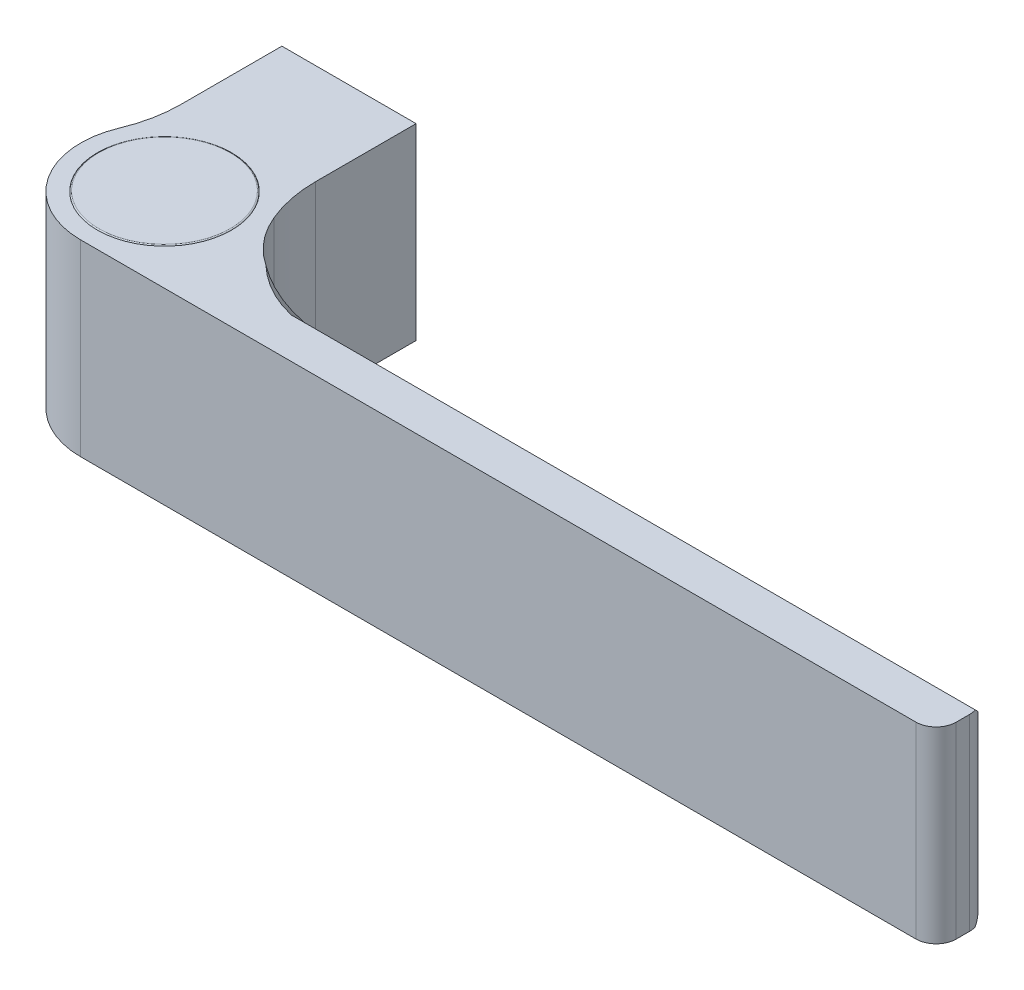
ISO-10303-21;
HEADER;
FILE_DESCRIPTION(('STEP AP214'),'2;1');
FILE_NAME('part.step','',(''),(''),'','','');
FILE_SCHEMA(('AUTOMOTIVE_DESIGN { 1 0 10303 214 1 1 1 1 }'));
ENDSEC;
DATA;
#1=APPLICATION_CONTEXT('core data for automotive mechanical design processes');
#2=APPLICATION_PROTOCOL_DEFINITION('international standard','automotive_design',2000,#1);
#3=PRODUCT_CONTEXT('',#1,'mechanical');
#4=PRODUCT('Part','Part','',(#3));
#5=PRODUCT_RELATED_PRODUCT_CATEGORY('part','',(#4));
#6=PRODUCT_DEFINITION_FORMATION('','',#4);
#7=PRODUCT_DEFINITION_CONTEXT('part definition',#1,'design');
#8=PRODUCT_DEFINITION('design','',#6,#7);
#9=PRODUCT_DEFINITION_SHAPE('','',#8);
#10=(LENGTH_UNIT() NAMED_UNIT(*) SI_UNIT(.MILLI.,.METRE.));
#11=(NAMED_UNIT(*) PLANE_ANGLE_UNIT() SI_UNIT($,.RADIAN.));
#12=(NAMED_UNIT(*) SI_UNIT($,.STERADIAN.) SOLID_ANGLE_UNIT());
#13=UNCERTAINTY_MEASURE_WITH_UNIT(LENGTH_MEASURE(1.E-05),#10,'distance_accuracy_value','');
#14=(GEOMETRIC_REPRESENTATION_CONTEXT(3) GLOBAL_UNCERTAINTY_ASSIGNED_CONTEXT((#13)) GLOBAL_UNIT_ASSIGNED_CONTEXT((#10,
#11,#12)) REPRESENTATION_CONTEXT('',''));
#15=CARTESIAN_POINT('',(0.,0.,0.));
#16=DIRECTION('',(0.,0.,1.));
#17=DIRECTION('',(1.,0.,0.));
#18=AXIS2_PLACEMENT_3D('',#15,#16,#17);
#19=CARTESIAN_POINT('',(0.,21.1,27.5));
#20=DIRECTION('',(0.,-1.,0.));
#21=DIRECTION('',(0.,0.,1.));
#22=AXIS2_PLACEMENT_3D('',#19,#20,#21);
#23=PLANE('',#22);
#24=CARTESIAN_POINT('',(0.,21.1,27.5));
#25=DIRECTION('',(0.,1.,0.));
#26=DIRECTION('',(-1.,0.,0.));
#27=AXIS2_PLACEMENT_3D('',#24,#25,#26);
#28=CIRCLE('',#27,9.8);
#29=CARTESIAN_POINT('',(-9.8,21.1,27.5));
#30=VERTEX_POINT('',#29);
#31=EDGE_CURVE('E9',#30,#30,#28,.T.);
#32=ORIENTED_EDGE('',*,*,#31,.T.);
#33=EDGE_LOOP('',(#32));
#34=FACE_BOUND('',#33,.T.);
#35=ADVANCED_FACE('F15',(#34),#23,.F.);
#36=CARTESIAN_POINT('',(0.,20.9,27.5));
#37=DIRECTION('',(0.,-1.,0.));
#38=DIRECTION('',(1.,0.,0.));
#39=AXIS2_PLACEMENT_3D('',#36,#37,#38);
#40=TOROIDAL_SURFACE('',#39,9.8,0.2);
#41=ORIENTED_EDGE('',*,*,#31,.F.);
#42=EDGE_LOOP('',(#41));
#43=FACE_BOUND('',#42,.T.);
#44=CARTESIAN_POINT('',(0.,20.9,27.5));
#45=DIRECTION('',(0.,1.,0.));
#46=DIRECTION('',(-1.,0.,0.));
#47=AXIS2_PLACEMENT_3D('',#44,#45,#46);
#48=CIRCLE('',#47,10.);
#49=CARTESIAN_POINT('',(-10.,20.9,27.5));
#50=VERTEX_POINT('',#49);
#51=EDGE_CURVE('E27',#50,#50,#48,.T.);
#52=ORIENTED_EDGE('',*,*,#51,.T.);
#53=EDGE_LOOP('',(#52));
#54=FACE_BOUND('',#53,.T.);
#55=ADVANCED_FACE('F430',(#43,#54),#40,.T.);
#56=CARTESIAN_POINT('',(0.,-7.1,27.5));
#57=DIRECTION('',(0.,1.,0.));
#58=DIRECTION('',(0.,0.,1.));
#59=AXIS2_PLACEMENT_3D('',#56,#57,#58);
#60=PLANE('',#59);
#61=CARTESIAN_POINT('',(0.,-7.1,27.5));
#62=DIRECTION('',(0.,-1.,0.));
#63=DIRECTION('',(-1.,0.,0.));
#64=AXIS2_PLACEMENT_3D('',#61,#62,#63);
#65=CIRCLE('',#64,9.8);
#66=CARTESIAN_POINT('',(-9.8,-7.1,27.5));
#67=VERTEX_POINT('',#66);
#68=EDGE_CURVE('E540',#67,#67,#65,.T.);
#69=ORIENTED_EDGE('',*,*,#68,.T.);
#70=EDGE_LOOP('',(#69));
#71=FACE_BOUND('',#70,.T.);
#72=ADVANCED_FACE('F436',(#71),#60,.F.);
#73=CARTESIAN_POINT('',(0.,14.,14.5));
#74=DIRECTION('',(0.,0.,-1.));
#75=DIRECTION('',(0.,1.,0.));
#76=AXIS2_PLACEMENT_3D('',#73,#74,#75);
#77=PLANE('',#76);
#78=CARTESIAN_POINT('',(0.,14.,14.5));
#79=DIRECTION('',(0.,0.,-1.));
#80=DIRECTION('',(0.,1.,0.));
#81=AXIS2_PLACEMENT_3D('',#78,#79,#80);
#82=CIRCLE('',#81,3.);
#83=CARTESIAN_POINT('',(0.,17.,14.5));
#84=VERTEX_POINT('',#83);
#85=EDGE_CURVE('E533',#84,#84,#82,.T.);
#86=ORIENTED_EDGE('',*,*,#85,.T.);
#87=EDGE_LOOP('',(#86));
#88=FACE_BOUND('',#87,.T.);
#89=ADVANCED_FACE('F450',(#88),#77,.T.);
#90=CARTESIAN_POINT('',(0.,0.,14.5));
#91=DIRECTION('',(0.,0.,-1.));
#92=DIRECTION('',(0.,1.,0.));
#93=AXIS2_PLACEMENT_3D('',#90,#91,#92);
#94=PLANE('',#93);
#95=CARTESIAN_POINT('',(0.,0.,14.5));
#96=DIRECTION('',(0.,0.,-1.));
#97=DIRECTION('',(0.,1.,0.));
#98=AXIS2_PLACEMENT_3D('',#95,#96,#97);
#99=CIRCLE('',#98,3.);
#100=CARTESIAN_POINT('',(0.,3.,14.5));
#101=VERTEX_POINT('',#100);
#102=EDGE_CURVE('E151',#101,#101,#99,.T.);
#103=ORIENTED_EDGE('',*,*,#102,.T.);
#104=EDGE_LOOP('',(#103));
#105=FACE_BOUND('',#104,.T.);
#106=ADVANCED_FACE('F456',(#105),#94,.T.);
#107=CARTESIAN_POINT('',(0.,-6.9,27.5));
#108=DIRECTION('',(0.,1.,0.));
#109=DIRECTION('',(-1.,0.,0.));
#110=AXIS2_PLACEMENT_3D('',#107,#108,#109);
#111=TOROIDAL_SURFACE('',#110,9.8,0.2);
#112=ORIENTED_EDGE('',*,*,#68,.F.);
#113=EDGE_LOOP('',(#112));
#114=FACE_BOUND('',#113,.T.);
#115=CARTESIAN_POINT('',(0.,-6.9,27.5));
#116=DIRECTION('',(0.,-1.,0.));
#117=DIRECTION('',(-1.,0.,0.));
#118=AXIS2_PLACEMENT_3D('',#115,#116,#117);
#119=CIRCLE('',#118,10.);
#120=CARTESIAN_POINT('',(-10.,-6.9,27.5));
#121=VERTEX_POINT('',#120);
#122=EDGE_CURVE('E536',#121,#121,#119,.T.);
#123=ORIENTED_EDGE('',*,*,#122,.T.);
#124=EDGE_LOOP('',(#123));
#125=FACE_BOUND('',#124,.T.);
#126=ADVANCED_FACE('F452',(#114,#125),#111,.T.);
#127=CARTESIAN_POINT('',(0.,14.,14.5));
#128=DIRECTION('',(0.,0.,-1.));
#129=DIRECTION('',(0.,1.,0.));
#130=AXIS2_PLACEMENT_3D('',#127,#128,#129);
#131=CYLINDRICAL_SURFACE('',#130,3.);
#132=ORIENTED_EDGE('',*,*,#85,.F.);
#133=EDGE_LOOP('',(#132));
#134=FACE_BOUND('',#133,.T.);
#135=CARTESIAN_POINT('',(0.,14.,0.25));
#136=DIRECTION('',(0.,0.,-1.));
#137=DIRECTION('',(0.,1.,0.));
#138=AXIS2_PLACEMENT_3D('',#135,#136,#137);
#139=CIRCLE('',#138,3.);
#140=CARTESIAN_POINT('',(0.,17.,0.25));
#141=VERTEX_POINT('',#140);
#142=EDGE_CURVE('E20',#141,#141,#139,.F.);
#143=ORIENTED_EDGE('',*,*,#142,.F.);
#144=EDGE_LOOP('',(#143));
#145=FACE_BOUND('',#144,.T.);
#146=ADVANCED_FACE('F455',(#134,#145),#131,.F.);
#147=CARTESIAN_POINT('',(0.,0.,14.5));
#148=DIRECTION('',(0.,0.,-1.));
#149=DIRECTION('',(0.,1.,0.));
#150=AXIS2_PLACEMENT_3D('',#147,#148,#149);
#151=CYLINDRICAL_SURFACE('',#150,3.);
#152=ORIENTED_EDGE('',*,*,#102,.F.);
#153=EDGE_LOOP('',(#152));
#154=FACE_BOUND('',#153,.T.);
#155=CARTESIAN_POINT('',(0.,0.,0.25));
#156=DIRECTION('',(0.,0.,-1.));
#157=DIRECTION('',(0.,1.,0.));
#158=AXIS2_PLACEMENT_3D('',#155,#156,#157);
#159=CIRCLE('',#158,3.);
#160=CARTESIAN_POINT('',(0.,3.,0.25));
#161=VERTEX_POINT('',#160);
#162=EDGE_CURVE('E192',#161,#161,#159,.F.);
#163=ORIENTED_EDGE('',*,*,#162,.F.);
#164=EDGE_LOOP('',(#163));
#165=FACE_BOUND('',#164,.T.);
#166=ADVANCED_FACE('F463',(#154,#165),#151,.F.);
#167=CARTESIAN_POINT('',(0.,-4.,27.5));
#168=DIRECTION('',(0.,1.,0.));
#169=DIRECTION('',(1.,0.,0.));
#170=AXIS2_PLACEMENT_3D('',#167,#168,#169);
#171=CYLINDRICAL_SURFACE('',#170,10.);
#172=ORIENTED_EDGE('',*,*,#122,.F.);
#173=EDGE_LOOP('',(#172));
#174=FACE_BOUND('',#173,.T.);
#175=CARTESIAN_POINT('',(0.,-7.,27.5));
#176=DIRECTION('',(0.,1.,0.));
#177=DIRECTION('',(-1.,0.,0.));
#178=AXIS2_PLACEMENT_3D('',#175,#176,#177);
#179=CIRCLE('',#178,10.);
#180=CARTESIAN_POINT('',(-10.,-7.,27.5));
#181=VERTEX_POINT('',#180);
#182=EDGE_CURVE('E237',#181,#181,#179,.T.);
#183=ORIENTED_EDGE('',*,*,#182,.F.);
#184=EDGE_LOOP('',(#183));
#185=FACE_BOUND('',#184,.T.);
#186=ADVANCED_FACE('F470',(#174,#185),#171,.F.);
#187=CARTESIAN_POINT('',(0.,14.,0.750000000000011));
#188=DIRECTION('',(0.,0.,-1.));
#189=DIRECTION('',(0.,1.,0.));
#190=AXIS2_PLACEMENT_3D('',#187,#188,#189);
#191=CONICAL_SURFACE('',#190,2.5,0.785398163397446);
#192=CARTESIAN_POINT('',(0.,14.,0.));
#193=DIRECTION('',(0.,0.,1.));
#194=DIRECTION('',(0.,-1.,0.));
#195=AXIS2_PLACEMENT_3D('',#192,#193,#194);
#196=CIRCLE('',#195,3.25);
#197=CARTESIAN_POINT('',(0.,10.75,0.));
#198=VERTEX_POINT('',#197);
#199=EDGE_CURVE('E356',#198,#198,#196,.T.);
#200=ORIENTED_EDGE('',*,*,#199,.F.);
#201=EDGE_LOOP('',(#200));
#202=FACE_BOUND('',#201,.T.);
#203=ORIENTED_EDGE('',*,*,#142,.T.);
#204=EDGE_LOOP('',(#203));
#205=FACE_BOUND('',#204,.T.);
#206=ADVANCED_FACE('F502',(#202,#205),#191,.F.);
#207=CARTESIAN_POINT('',(0.,0.,0.750000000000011));
#208=DIRECTION('',(0.,0.,-1.));
#209=DIRECTION('',(0.,1.,0.));
#210=AXIS2_PLACEMENT_3D('',#207,#208,#209);
#211=CONICAL_SURFACE('',#210,2.5,0.785398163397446);
#212=ORIENTED_EDGE('',*,*,#162,.T.);
#213=EDGE_LOOP('',(#212));
#214=FACE_BOUND('',#213,.T.);
#215=CARTESIAN_POINT('',(0.,0.,0.));
#216=DIRECTION('',(0.,0.,1.));
#217=DIRECTION('',(0.,-1.,0.));
#218=AXIS2_PLACEMENT_3D('',#215,#216,#217);
#219=CIRCLE('',#218,3.25);
#220=CARTESIAN_POINT('',(0.,-3.25,0.));
#221=VERTEX_POINT('',#220);
#222=EDGE_CURVE('E373',#221,#221,#219,.T.);
#223=ORIENTED_EDGE('',*,*,#222,.F.);
#224=EDGE_LOOP('',(#223));
#225=FACE_BOUND('',#224,.T.);
#226=ADVANCED_FACE('F197',(#214,#225),#211,.F.);
#227=CARTESIAN_POINT('',(25.4165300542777,-7.,34.));
#228=CARTESIAN_POINT('',(22.3822222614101,-7.3332196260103,33.6667803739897));
#229=CARTESIAN_POINT('',(19.4967402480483,-8.1238734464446,32.8761265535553));
#230=CARTESIAN_POINT('',(17.0799276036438,-9.2649968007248,31.7350031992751));
#231=B_SPLINE_CURVE_WITH_KNOTS('',3,(#227,#228,#229,#230),.UNSPECIFIED.,.F.,.F.,(4,4),(0.,1.),.UNSPECIFIED.);
#232=DIRECTION('',(0.,0.707106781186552,-0.707106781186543));
#233=VECTOR('',#232,1.);
#234=SURFACE_OF_LINEAR_EXTRUSION('',#231,#233);
#235=CARTESIAN_POINT('',(17.0799276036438,-7.00000000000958,29.4700063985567));
#236=CARTESIAN_POINT('',(17.4619964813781,-7.00000000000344,29.8308120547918));
#237=CARTESIAN_POINT('',(17.8584297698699,-7.00000000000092,30.1765777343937));
#238=CARTESIAN_POINT('',(18.6785782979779,-6.99999999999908,30.8350602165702));
#239=CARTESIAN_POINT('',(19.1023242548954,-6.99999999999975,31.1477387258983));
#240=CARTESIAN_POINT('',(19.9763809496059,-7.00000000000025,31.7373246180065));
#241=CARTESIAN_POINT('',(20.426784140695,-7.00000000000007,32.0140954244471));
#242=CARTESIAN_POINT('',(21.3499718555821,-6.99999999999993,32.5266736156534));
#243=CARTESIAN_POINT('',(21.8227418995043,-6.99999999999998,32.7625070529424));
#244=CARTESIAN_POINT('',(22.8050849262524,-7.00000000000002,33.1971640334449));
#245=CARTESIAN_POINT('',(23.3153669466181,-7.,33.3944022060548));
#246=CARTESIAN_POINT('',(24.0939087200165,-7.,33.6513851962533));
#247=CARTESIAN_POINT('',(24.3558587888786,-7.,33.7306226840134));
#248=CARTESIAN_POINT('',(24.8835150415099,-7.,33.8755764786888));
#249=CARTESIAN_POINT('',(25.1492218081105,-7.,33.9412906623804));
#250=CARTESIAN_POINT('',(25.4165300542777,-7.,34.));
#251=B_SPLINE_CURVE_WITH_KNOTS('',3,(#235,#236,#237,#238,#239,#240,#241,#242,#243,#244,#245,
#246,#247,#248,#249,#250),.UNSPECIFIED.,.F.,.F.,(4,2,2,2,2,2,2,4),(0.,1.57628478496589,
3.15437436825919,4.73830050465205,6.3212149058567,7.95956468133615,8.78026720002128,
9.60109847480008),.UNSPECIFIED.);
#252=CARTESIAN_POINT('',(17.0799276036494,-7.00000000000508,29.4700063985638));
#253=VERTEX_POINT('',#252);
#254=CARTESIAN_POINT('',(25.4165300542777,-7.,34.));
#255=VERTEX_POINT('',#254);
#256=EDGE_CURVE('E243',#253,#255,#251,.T.);
#257=ORIENTED_EDGE('',*,*,#256,.F.);
#258=CARTESIAN_POINT('',(17.0799276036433,-7.00000000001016,29.4700063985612));
#259=CARTESIAN_POINT('',(17.182501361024,-6.97171133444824,29.5385806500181));
#260=CARTESIAN_POINT('',(17.2859206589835,-6.94341803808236,29.6058881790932));
#261=CARTESIAN_POINT('',(17.4942076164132,-6.88687534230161,29.7378167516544));
#262=CARTESIAN_POINT('',(17.5990724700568,-6.85862595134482,29.8024422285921));
#263=CARTESIAN_POINT('',(17.8102406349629,-6.80215908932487,29.9290176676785));
#264=CARTESIAN_POINT('',(17.9165421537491,-6.77394161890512,29.9909706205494));
#265=CARTESIAN_POINT('',(18.1305763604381,-6.7175270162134,30.1122079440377));
#266=CARTESIAN_POINT('',(18.2383081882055,-6.68932988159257,30.1714938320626));
#267=CARTESIAN_POINT('',(18.4551989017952,-6.63294450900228,30.2873995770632));
#268=CARTESIAN_POINT('',(18.5643577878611,-6.60475627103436,30.3440194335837));
#269=CARTESIAN_POINT('',(18.7841010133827,-6.54837747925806,30.4545911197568));
#270=CARTESIAN_POINT('',(18.8946861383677,-6.52018693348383,30.5085413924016));
#271=CARTESIAN_POINT('',(19.1172824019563,-6.46379254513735,30.6137669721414));
#272=CARTESIAN_POINT('',(19.2292950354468,-6.43558872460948,30.6650391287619));
#273=CARTESIAN_POINT('',(19.4547490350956,-6.37915691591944,30.7648972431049));
#274=CARTESIAN_POINT('',(19.5681925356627,-6.35092897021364,30.8134784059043));
#275=CARTESIAN_POINT('',(19.6822216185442,-6.32271603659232,30.8606531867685));
#276=B_SPLINE_CURVE_WITH_KNOTS('',3,(#258,#259,#260,#261,#262,#263,#264,#265,#266,#267,#268,
#269,#270,#271,#272,#273,#274,#275),.UNSPECIFIED.,.F.,.F.,(4,2,2,2,2,2,2,2,4),(0.,
0.379749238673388,0.758843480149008,1.13750186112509,1.51594200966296,1.89438222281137,
2.27304061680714,2.65213486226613,3.03188419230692),.UNSPECIFIED.);
#277=CARTESIAN_POINT('',(19.6822215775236,-6.32271612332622,30.8606533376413));
#278=VERTEX_POINT('',#277);
#279=EDGE_CURVE('E145',#253,#278,#276,.T.);
#280=ORIENTED_EDGE('',*,*,#279,.T.);
#281=CARTESIAN_POINT('',(25.4165300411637,-5.00000000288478,32.0000000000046));
#282=CARTESIAN_POINT('',(25.0360234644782,-5.08368728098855,32.0001625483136));
#283=CARTESIAN_POINT('',(24.6555809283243,-5.16778751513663,31.9857573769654));
#284=CARTESIAN_POINT('',(23.899733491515,-5.33614701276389,31.9282779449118));
#285=CARTESIAN_POINT('',(23.5243119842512,-5.42040097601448,31.8854064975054));
#286=CARTESIAN_POINT('',(22.8552807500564,-5.57206188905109,31.7832556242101));
#287=CARTESIAN_POINT('',(22.5608317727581,-5.63934368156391,31.7292139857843));
#288=CARTESIAN_POINT('',(21.9757235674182,-5.77429015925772,31.6035996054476));
#289=CARTESIAN_POINT('',(21.6850649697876,-5.84195490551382,31.5320239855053));
#290=CARTESIAN_POINT('',(21.1053781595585,-5.97834760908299,31.3707045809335));
#291=CARTESIAN_POINT('',(20.8164051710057,-6.04707895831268,31.2807652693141));
#292=CARTESIAN_POINT('',(20.2445202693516,-6.18475552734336,31.0835926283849));
#293=CARTESIAN_POINT('',(19.9616075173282,-6.25370071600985,30.9763617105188));
#294=CARTESIAN_POINT('',(19.6822215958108,-6.32271621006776,30.8606533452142));
#295=B_SPLINE_CURVE_WITH_KNOTS('',3,(#281,#282,#283,#284,#285,#286,#287,#288,#289,#290,#291,
#292,#293,#294),.UNSPECIFIED.,.F.,.F.,(4,2,2,2,2,2,4),(0.,1.16857682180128,2.32891597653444,
3.24891760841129,4.16907035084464,5.0995855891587,6.02997117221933),.UNSPECIFIED.);
#296=CARTESIAN_POINT('',(25.4165300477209,-5.0000000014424,32.0000000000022));
#297=VERTEX_POINT('',#296);
#298=EDGE_CURVE('E139',#297,#278,#295,.T.);
#299=ORIENTED_EDGE('',*,*,#298,.F.);
#300=DIRECTION('',(0.,0.707106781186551,-0.707106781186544));
#301=VECTOR('',#300,1.);
#302=CARTESIAN_POINT('',(25.416530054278,-7.,34.));
#303=LINE('',#302,#301);
#304=EDGE_CURVE('E143',#297,#255,#303,.F.);
#305=ORIENTED_EDGE('',*,*,#304,.T.);
#306=EDGE_LOOP('',(#257,#280,#299,#305));
#307=FACE_BOUND('',#306,.T.);
#308=ADVANCED_FACE('F142',(#307),#234,.T.);
#309=CARTESIAN_POINT('',(25.4114323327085,-5.6617904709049,17.0256546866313));
#310=DIRECTION('',(0.,-1.,0.));
#311=DIRECTION('',(0.0003404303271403,0.,0.999999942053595));
#312=AXIS2_PLACEMENT_3D('',#309,#310,#311);
#313=CYLINDRICAL_SURFACE('',#312,14.9743461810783);
#314=ORIENTED_EDGE('',*,*,#298,.T.);
#315=DIRECTION('',(0.,-1.,0.));
#316=VECTOR('',#315,1.);
#317=CARTESIAN_POINT('',(19.6822215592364,-5.6617904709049,30.8606533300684));
#318=LINE('',#317,#316);
#319=CARTESIAN_POINT('',(19.6822215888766,-6.999999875,30.8606532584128));
#320=VERTEX_POINT('',#319);
#321=EDGE_CURVE('E291',#278,#320,#318,.T.);
#322=ORIENTED_EDGE('',*,*,#321,.T.);
#323=CARTESIAN_POINT('',(25.4114323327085,-7.,17.0256546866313));
#324=DIRECTION('',(0.,1.,0.));
#325=DIRECTION('',(-0.382601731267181,0.,0.923913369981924));
#326=AXIS2_PLACEMENT_3D('',#323,#324,#325);
#327=CIRCLE('',#326,14.9743461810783);
#328=CARTESIAN_POINT('',(25.4165300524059,-7.,32.0000000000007));
#329=VERTEX_POINT('',#328);
#330=EDGE_CURVE('E180',#320,#329,#327,.T.);
#331=ORIENTED_EDGE('',*,*,#330,.T.);
#332=DIRECTION('',(0.,-1.,0.));
#333=VECTOR('',#332,1.);
#334=CARTESIAN_POINT('',(25.4165300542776,-5.6617904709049,32.));
#335=LINE('',#334,#333);
#336=EDGE_CURVE('E168',#329,#297,#335,.F.);
#337=ORIENTED_EDGE('',*,*,#336,.T.);
#338=EDGE_LOOP('',(#314,#322,#331,#337));
#339=FACE_BOUND('',#338,.T.);
#340=ADVANCED_FACE('F17',(#339),#313,.T.);
#341=CARTESIAN_POINT('',(127.5,-7.,32.));
#342=DIRECTION('',(0.,0.,1.));
#343=DIRECTION('',(1.,0.,0.));
#344=AXIS2_PLACEMENT_3D('',#341,#342,#343);
#345=PLANE('',#344);
#346=DIRECTION('',(0.,-1.,0.));
#347=VECTOR('',#346,1.);
#348=CARTESIAN_POINT('',(124.5,-7.,32.));
#349=LINE('',#348,#347);
#350=CARTESIAN_POINT('',(124.5,-5.,32.));
#351=VERTEX_POINT('',#350);
#352=CARTESIAN_POINT('',(124.5,19.,32.));
#353=VERTEX_POINT('',#352);
#354=EDGE_CURVE('E177',#351,#353,#349,.F.);
#355=ORIENTED_EDGE('',*,*,#354,.F.);
#356=DIRECTION('',(-1.,0.,0.));
#357=VECTOR('',#356,1.);
#358=CARTESIAN_POINT('',(124.5,-5.,32.));
#359=LINE('',#358,#357);
#360=EDGE_CURVE('E159',#351,#297,#359,.T.);
#361=ORIENTED_EDGE('',*,*,#360,.T.);
#362=DIRECTION('',(0.,-1.,0.));
#363=VECTOR('',#362,1.);
#364=CARTESIAN_POINT('',(25.4165300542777,-7.,32.));
#365=LINE('',#364,#363);
#366=CARTESIAN_POINT('',(25.4165300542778,19.,32.));
#367=VERTEX_POINT('',#366);
#368=EDGE_CURVE('E166',#367,#297,#365,.T.);
#369=ORIENTED_EDGE('',*,*,#368,.F.);
#370=DIRECTION('',(1.,0.,0.));
#371=VECTOR('',#370,1.);
#372=CARTESIAN_POINT('',(25.4165300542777,19.,32.));
#373=LINE('',#372,#371);
#374=EDGE_CURVE('E178',#367,#353,#373,.T.);
#375=ORIENTED_EDGE('',*,*,#374,.T.);
#376=EDGE_LOOP('',(#355,#361,#369,#375));
#377=FACE_BOUND('',#376,.T.);
#378=ADVANCED_FACE('F176',(#377),#345,.F.);
#379=CARTESIAN_POINT('',(127.5,-7.,34.));
#380=DIRECTION('',(0.,-0.707106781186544,-0.707106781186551));
#381=DIRECTION('',(-1.,0.,0.));
#382=AXIS2_PLACEMENT_3D('',#379,#380,#381);
#383=PLANE('',#382);
#384=ORIENTED_EDGE('',*,*,#304,.F.);
#385=ORIENTED_EDGE('',*,*,#360,.F.);
#386=CARTESIAN_POINT('',(124.5,-8.,35.));
#387=DIRECTION('',(0.,-0.707106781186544,-0.707106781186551));
#388=DIRECTION('',(0.,-0.707106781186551,0.707106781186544));
#389=AXIS2_PLACEMENT_3D('',#386,#387,#388);
#390=ELLIPSE('',#389,4.24264068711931,3.);
#391=CARTESIAN_POINT('',(127.328427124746,-7.,34.));
#392=VERTEX_POINT('',#391);
#393=EDGE_CURVE('E289',#351,#392,#390,.T.);
#394=ORIENTED_EDGE('',*,*,#393,.T.);
#395=CARTESIAN_POINT('',(25.4165300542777,-7.,34.));
#396=CARTESIAN_POINT('',(127.328427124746,-7.,34.));
#397=B_SPLINE_CURVE_WITH_KNOTS('',1,(#395,#396),.UNSPECIFIED.,.F.,.F.,(2,2),(0.,1.),.UNSPECIFIED.);
#398=EDGE_CURVE('E161',#255,#392,#397,.T.);
#399=ORIENTED_EDGE('',*,*,#398,.F.);
#400=EDGE_LOOP('',(#384,#385,#394,#399));
#401=FACE_BOUND('',#400,.T.);
#402=ADVANCED_FACE('F156',(#401),#383,.T.);
#403=CARTESIAN_POINT('',(0.,-7.,27.5));
#404=DIRECTION('',(0.,-1.,0.));
#405=DIRECTION('',(1.,0.,0.));
#406=AXIS2_PLACEMENT_3D('',#403,#404,#405);
#407=PLANE('',#406);
#408=CARTESIAN_POINT('',(0.,-7.,27.5));
#409=DIRECTION('',(0.,-1.,0.));
#410=DIRECTION('',(0.923076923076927,0.,-0.384615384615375));
#411=AXIS2_PLACEMENT_3D('',#408,#409,#410);
#412=CIRCLE('',#411,12.5);
#413=CARTESIAN_POINT('',(11.5384615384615,-7.,22.6923076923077));
#414=VERTEX_POINT('',#413);
#415=CARTESIAN_POINT('',(11.5529682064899,-7.,22.7272727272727));
#416=VERTEX_POINT('',#415);
#417=EDGE_CURVE('E232',#414,#416,#412,.T.);
#418=ORIENTED_EDGE('',*,*,#417,.T.);
#419=CARTESIAN_POINT('',(25.4165300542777,-7.,17.));
#420=DIRECTION('',(0.,-1.,0.));
#421=DIRECTION('',(1.,0.,0.));
#422=AXIS2_PLACEMENT_3D('',#419,#420,#421);
#423=CIRCLE('',#422,15.);
#424=EDGE_CURVE('E250',#416,#253,#423,.F.);
#425=ORIENTED_EDGE('',*,*,#424,.T.);
#426=ORIENTED_EDGE('',*,*,#256,.T.);
#427=ORIENTED_EDGE('',*,*,#398,.T.);
#428=CARTESIAN_POINT('',(124.5,-7.,35.));
#429=DIRECTION('',(0.,-1.,0.));
#430=DIRECTION('',(1.,0.,0.));
#431=AXIS2_PLACEMENT_3D('',#428,#429,#430);
#432=CIRCLE('',#431,3.);
#433=CARTESIAN_POINT('',(127.5,-7.,35.));
#434=VERTEX_POINT('',#433);
#435=EDGE_CURVE('E241',#392,#434,#432,.T.);
#436=ORIENTED_EDGE('',*,*,#435,.T.);
#437=DIRECTION('',(0.,0.,1.));
#438=VECTOR('',#437,1.);
#439=CARTESIAN_POINT('',(127.5,-7.,35.));
#440=LINE('',#439,#438);
#441=CARTESIAN_POINT('',(127.5,-7.,37.));
#442=VERTEX_POINT('',#441);
#443=EDGE_CURVE('E408',#434,#442,#440,.T.);
#444=ORIENTED_EDGE('',*,*,#443,.T.);
#445=CARTESIAN_POINT('',(124.5,-7.,37.));
#446=DIRECTION('',(0.,-1.,0.));
#447=DIRECTION('',(1.,0.,0.));
#448=AXIS2_PLACEMENT_3D('',#445,#446,#447);
#449=CIRCLE('',#448,3.);
#450=CARTESIAN_POINT('',(124.5,-7.,40.));
#451=VERTEX_POINT('',#450);
#452=EDGE_CURVE('E395',#442,#451,#449,.T.);
#453=ORIENTED_EDGE('',*,*,#452,.T.);
#454=DIRECTION('',(-1.,0.,0.));
#455=VECTOR('',#454,1.);
#456=CARTESIAN_POINT('',(124.5,-7.,40.));
#457=LINE('',#456,#455);
#458=CARTESIAN_POINT('',(0.,-7.,40.));
#459=VERTEX_POINT('',#458);
#460=EDGE_CURVE('E390',#451,#459,#457,.T.);
#461=ORIENTED_EDGE('',*,*,#460,.T.);
#462=CARTESIAN_POINT('',(0.,-7.,27.5));
#463=DIRECTION('',(0.,-1.,0.));
#464=DIRECTION('',(-1.,0.,0.));
#465=AXIS2_PLACEMENT_3D('',#462,#463,#464);
#466=CIRCLE('',#465,12.5);
#467=CARTESIAN_POINT('',(-11.5384615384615,-7.,22.6923076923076));
#468=VERTEX_POINT('',#467);
#469=EDGE_CURVE('E382',#459,#468,#466,.T.);
#470=ORIENTED_EDGE('',*,*,#469,.T.);
#471=CARTESIAN_POINT('',(-30.,-7.,15.));
#472=DIRECTION('',(0.,1.,0.));
#473=DIRECTION('',(0.923076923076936,0.,0.384615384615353));
#474=AXIS2_PLACEMENT_3D('',#471,#472,#473);
#475=CIRCLE('',#474,20.);
#476=CARTESIAN_POINT('',(-10.,-7.,15.));
#477=VERTEX_POINT('',#476);
#478=EDGE_CURVE('E367',#468,#477,#475,.T.);
#479=ORIENTED_EDGE('',*,*,#478,.T.);
#480=DIRECTION('',(0.,0.,-1.));
#481=VECTOR('',#480,1.);
#482=CARTESIAN_POINT('',(-10.,-7.,14.9999999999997));
#483=LINE('',#482,#481);
#484=CARTESIAN_POINT('',(-10.,-7.,0.));
#485=VERTEX_POINT('',#484);
#486=EDGE_CURVE('E370',#477,#485,#483,.T.);
#487=ORIENTED_EDGE('',*,*,#486,.T.);
#488=DIRECTION('',(1.,0.,0.));
#489=VECTOR('',#488,1.);
#490=CARTESIAN_POINT('',(-10.,-7.,0.));
#491=LINE('',#490,#489);
#492=CARTESIAN_POINT('',(10.,-7.,0.));
#493=VERTEX_POINT('',#492);
#494=EDGE_CURVE('E355',#485,#493,#491,.T.);
#495=ORIENTED_EDGE('',*,*,#494,.T.);
#496=DIRECTION('',(0.,0.,1.));
#497=VECTOR('',#496,1.);
#498=CARTESIAN_POINT('',(10.,-7.,0.));
#499=LINE('',#498,#497);
#500=CARTESIAN_POINT('',(10.,-7.,15.));
#501=VERTEX_POINT('',#500);
#502=EDGE_CURVE('E351',#493,#501,#499,.T.);
#503=ORIENTED_EDGE('',*,*,#502,.T.);
#504=CARTESIAN_POINT('',(30.,-7.,15.));
#505=DIRECTION('',(0.,1.,0.));
#506=DIRECTION('',(-1.,0.,0.));
#507=AXIS2_PLACEMENT_3D('',#504,#505,#506);
#508=CIRCLE('',#507,20.);
#509=EDGE_CURVE('E349',#501,#414,#508,.T.);
#510=ORIENTED_EDGE('',*,*,#509,.T.);
#511=EDGE_LOOP('',(#418,#425,#426,#427,#436,#444,#453,#461,#470,#479,#487,#495,#503,#510));
#512=FACE_BOUND('',#511,.T.);
#513=ORIENTED_EDGE('',*,*,#182,.T.);
#514=EDGE_LOOP('',(#513));
#515=FACE_BOUND('',#514,.T.);
#516=ADVANCED_FACE('F252',(#512,#515),#407,.T.);
#517=CARTESIAN_POINT('',(127.5,-7.,40.));
#518=DIRECTION('',(-1.,0.,0.));
#519=DIRECTION('',(0.,-1.,0.));
#520=AXIS2_PLACEMENT_3D('',#517,#518,#519);
#521=PLANE('',#520);
#522=DIRECTION('',(0.,-1.,0.));
#523=VECTOR('',#522,1.);
#524=CARTESIAN_POINT('',(127.5,-7.,35.));
#525=LINE('',#524,#523);
#526=CARTESIAN_POINT('',(127.5,21.,35.));
#527=VERTEX_POINT('',#526);
#528=EDGE_CURVE('E223',#527,#434,#525,.T.);
#529=ORIENTED_EDGE('',*,*,#528,.F.);
#530=DIRECTION('',(0.,0.,-1.));
#531=VECTOR('',#530,1.);
#532=CARTESIAN_POINT('',(127.5,21.,37.));
#533=LINE('',#532,#531);
#534=CARTESIAN_POINT('',(127.5,21.,37.));
#535=VERTEX_POINT('',#534);
#536=EDGE_CURVE('E231',#535,#527,#533,.T.);
#537=ORIENTED_EDGE('',*,*,#536,.F.);
#538=DIRECTION('',(0.,1.,0.));
#539=VECTOR('',#538,1.);
#540=CARTESIAN_POINT('',(127.5,-7.,37.));
#541=LINE('',#540,#539);
#542=EDGE_CURVE('E409',#442,#535,#541,.T.);
#543=ORIENTED_EDGE('',*,*,#542,.F.);
#544=ORIENTED_EDGE('',*,*,#443,.F.);
#545=EDGE_LOOP('',(#529,#537,#543,#544));
#546=FACE_BOUND('',#545,.T.);
#547=ADVANCED_FACE('F257',(#546),#521,.F.);
#548=CARTESIAN_POINT('',(124.5,-7.,37.));
#549=DIRECTION('',(0.,-1.,0.));
#550=DIRECTION('',(-1.,0.,0.));
#551=AXIS2_PLACEMENT_3D('',#548,#549,#550);
#552=CYLINDRICAL_SURFACE('',#551,3.);
#553=ORIENTED_EDGE('',*,*,#542,.T.);
#554=CARTESIAN_POINT('',(124.5,21.,37.));
#555=DIRECTION('',(0.,1.,0.));
#556=DIRECTION('',(0.,0.,1.));
#557=AXIS2_PLACEMENT_3D('',#554,#555,#556);
#558=CIRCLE('',#557,3.);
#559=CARTESIAN_POINT('',(124.5,21.,40.));
#560=VERTEX_POINT('',#559);
#561=EDGE_CURVE('E403',#560,#535,#558,.T.);
#562=ORIENTED_EDGE('',*,*,#561,.F.);
#563=DIRECTION('',(0.,-1.,0.));
#564=VECTOR('',#563,1.);
#565=CARTESIAN_POINT('',(124.5,21.,40.));
#566=LINE('',#565,#564);
#567=EDGE_CURVE('E400',#560,#451,#566,.T.);
#568=ORIENTED_EDGE('',*,*,#567,.T.);
#569=ORIENTED_EDGE('',*,*,#452,.F.);
#570=EDGE_LOOP('',(#553,#562,#568,#569));
#571=FACE_BOUND('',#570,.T.);
#572=ADVANCED_FACE('F417',(#571),#552,.T.);
#573=CARTESIAN_POINT('',(0.,-7.,40.));
#574=DIRECTION('',(0.,0.,-1.));
#575=DIRECTION('',(0.,1.,0.));
#576=AXIS2_PLACEMENT_3D('',#573,#574,#575);
#577=PLANE('',#576);
#578=ORIENTED_EDGE('',*,*,#567,.F.);
#579=DIRECTION('',(1.,0.,0.));
#580=VECTOR('',#579,1.);
#581=CARTESIAN_POINT('',(0.,21.,40.));
#582=LINE('',#581,#580);
#583=CARTESIAN_POINT('',(0.,21.,40.));
#584=VERTEX_POINT('',#583);
#585=EDGE_CURVE('E391',#584,#560,#582,.T.);
#586=ORIENTED_EDGE('',*,*,#585,.F.);
#587=DIRECTION('',(0.,1.,0.));
#588=VECTOR('',#587,1.);
#589=CARTESIAN_POINT('',(0.,-7.,40.));
#590=LINE('',#589,#588);
#591=EDGE_CURVE('E394',#459,#584,#590,.T.);
#592=ORIENTED_EDGE('',*,*,#591,.F.);
#593=ORIENTED_EDGE('',*,*,#460,.F.);
#594=EDGE_LOOP('',(#578,#586,#592,#593));
#595=FACE_BOUND('',#594,.T.);
#596=ADVANCED_FACE('F479',(#595),#577,.F.);
#597=CARTESIAN_POINT('',(0.,-7.,27.5));
#598=DIRECTION('',(0.,-1.,0.));
#599=DIRECTION('',(-1.,0.,0.));
#600=AXIS2_PLACEMENT_3D('',#597,#598,#599);
#601=CYLINDRICAL_SURFACE('',#600,12.5);
#602=ORIENTED_EDGE('',*,*,#469,.F.);
#603=ORIENTED_EDGE('',*,*,#591,.T.);
#604=CARTESIAN_POINT('',(0.,21.,27.5));
#605=DIRECTION('',(0.,1.,0.));
#606=DIRECTION('',(-0.923076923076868,0.,-0.384615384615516));
#607=AXIS2_PLACEMENT_3D('',#604,#605,#606);
#608=CIRCLE('',#607,12.5);
#609=CARTESIAN_POINT('',(-11.5384615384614,21.,22.6923076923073));
#610=VERTEX_POINT('',#609);
#611=EDGE_CURVE('E386',#610,#584,#608,.T.);
#612=ORIENTED_EDGE('',*,*,#611,.F.);
#613=DIRECTION('',(0.,-1.,0.));
#614=VECTOR('',#613,1.);
#615=CARTESIAN_POINT('',(-11.5384615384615,21.,22.6923076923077));
#616=LINE('',#615,#614);
#617=EDGE_CURVE('E383',#610,#468,#616,.T.);
#618=ORIENTED_EDGE('',*,*,#617,.T.);
#619=EDGE_LOOP('',(#602,#603,#612,#618));
#620=FACE_BOUND('',#619,.T.);
#621=ADVANCED_FACE('F482',(#620),#601,.T.);
#622=CARTESIAN_POINT('',(-30.,-7.,15.));
#623=DIRECTION('',(0.,-1.,0.));
#624=DIRECTION('',(-1.,0.,0.));
#625=AXIS2_PLACEMENT_3D('',#622,#623,#624);
#626=CYLINDRICAL_SURFACE('',#625,20.);
#627=ORIENTED_EDGE('',*,*,#617,.F.);
#628=CARTESIAN_POINT('',(-30.,21.,15.));
#629=DIRECTION('',(0.,-1.,0.));
#630=DIRECTION('',(1.,0.,0.));
#631=AXIS2_PLACEMENT_3D('',#628,#629,#630);
#632=CIRCLE('',#631,20.);
#633=CARTESIAN_POINT('',(-10.,21.,15.));
#634=VERTEX_POINT('',#633);
#635=EDGE_CURVE('E377',#634,#610,#632,.T.);
#636=ORIENTED_EDGE('',*,*,#635,.F.);
#637=DIRECTION('',(0.,-1.,0.));
#638=VECTOR('',#637,1.);
#639=CARTESIAN_POINT('',(-10.,21.,15.));
#640=LINE('',#639,#638);
#641=EDGE_CURVE('E374',#634,#477,#640,.T.);
#642=ORIENTED_EDGE('',*,*,#641,.T.);
#643=ORIENTED_EDGE('',*,*,#478,.F.);
#644=EDGE_LOOP('',(#627,#636,#642,#643));
#645=FACE_BOUND('',#644,.T.);
#646=ADVANCED_FACE('F486',(#645),#626,.F.);
#647=CARTESIAN_POINT('',(-10.,-7.,20.));
#648=DIRECTION('',(1.,0.,0.));
#649=DIRECTION('',(0.,0.,1.));
#650=AXIS2_PLACEMENT_3D('',#647,#648,#649);
#651=PLANE('',#650);
#652=ORIENTED_EDGE('',*,*,#641,.F.);
#653=DIRECTION('',(0.,0.,1.));
#654=VECTOR('',#653,1.);
#655=CARTESIAN_POINT('',(-10.,21.,0.));
#656=LINE('',#655,#654);
#657=CARTESIAN_POINT('',(-10.,21.,0.));
#658=VERTEX_POINT('',#657);
#659=EDGE_CURVE('E363',#658,#634,#656,.T.);
#660=ORIENTED_EDGE('',*,*,#659,.F.);
#661=DIRECTION('',(0.,-1.,0.));
#662=VECTOR('',#661,1.);
#663=CARTESIAN_POINT('',(-10.,21.,0.));
#664=LINE('',#663,#662);
#665=EDGE_CURVE('E366',#658,#485,#664,.T.);
#666=ORIENTED_EDGE('',*,*,#665,.T.);
#667=ORIENTED_EDGE('',*,*,#486,.F.);
#668=EDGE_LOOP('',(#652,#660,#666,#667));
#669=FACE_BOUND('',#668,.T.);
#670=ADVANCED_FACE('F490',(#669),#651,.F.);
#671=CARTESIAN_POINT('',(-10.,-7.,0.));
#672=DIRECTION('',(0.,0.,1.));
#673=DIRECTION('',(1.,0.,0.));
#674=AXIS2_PLACEMENT_3D('',#671,#672,#673);
#675=PLANE('',#674);
#676=ORIENTED_EDGE('',*,*,#222,.T.);
#677=EDGE_LOOP('',(#676));
#678=FACE_BOUND('',#677,.T.);
#679=ORIENTED_EDGE('',*,*,#199,.T.);
#680=EDGE_LOOP('',(#679));
#681=FACE_BOUND('',#680,.T.);
#682=DIRECTION('',(0.,-1.,0.));
#683=VECTOR('',#682,1.);
#684=CARTESIAN_POINT('',(10.,21.,0.));
#685=LINE('',#684,#683);
#686=CARTESIAN_POINT('',(10.,21.,0.));
#687=VERTEX_POINT('',#686);
#688=EDGE_CURVE('E352',#687,#493,#685,.T.);
#689=ORIENTED_EDGE('',*,*,#688,.T.);
#690=ORIENTED_EDGE('',*,*,#494,.F.);
#691=ORIENTED_EDGE('',*,*,#665,.F.);
#692=DIRECTION('',(-1.,0.,0.));
#693=VECTOR('',#692,1.);
#694=CARTESIAN_POINT('',(10.,21.,0.));
#695=LINE('',#694,#693);
#696=EDGE_CURVE('E357',#687,#658,#695,.T.);
#697=ORIENTED_EDGE('',*,*,#696,.F.);
#698=EDGE_LOOP('',(#689,#690,#691,#697));
#699=FACE_BOUND('',#698,.T.);
#700=ADVANCED_FACE('F494',(#678,#681,#699),#675,.F.);
#701=CARTESIAN_POINT('',(10.,-7.,20.));
#702=DIRECTION('',(-1.,0.,0.));
#703=DIRECTION('',(0.,-1.,0.));
#704=AXIS2_PLACEMENT_3D('',#701,#702,#703);
#705=PLANE('',#704);
#706=DIRECTION('',(0.,1.,0.));
#707=VECTOR('',#706,1.);
#708=CARTESIAN_POINT('',(10.,-7.,15.));
#709=LINE('',#708,#707);
#710=CARTESIAN_POINT('',(10.,21.,15.));
#711=VERTEX_POINT('',#710);
#712=EDGE_CURVE('E360',#501,#711,#709,.T.);
#713=ORIENTED_EDGE('',*,*,#712,.F.);
#714=ORIENTED_EDGE('',*,*,#502,.F.);
#715=ORIENTED_EDGE('',*,*,#688,.F.);
#716=DIRECTION('',(0.,0.,-1.));
#717=VECTOR('',#716,1.);
#718=CARTESIAN_POINT('',(10.,21.,14.9999999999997));
#719=LINE('',#718,#717);
#720=EDGE_CURVE('E36',#711,#687,#719,.T.);
#721=ORIENTED_EDGE('',*,*,#720,.F.);
#722=EDGE_LOOP('',(#713,#714,#715,#721));
#723=FACE_BOUND('',#722,.T.);
#724=ADVANCED_FACE('F498',(#723),#705,.F.);
#725=CARTESIAN_POINT('',(30.,-7.,15.));
#726=DIRECTION('',(0.,-1.,0.));
#727=DIRECTION('',(-1.,0.,0.));
#728=AXIS2_PLACEMENT_3D('',#725,#726,#727);
#729=CYLINDRICAL_SURFACE('',#728,20.);
#730=ORIENTED_EDGE('',*,*,#712,.T.);
#731=CARTESIAN_POINT('',(30.,21.,15.));
#732=DIRECTION('',(0.,-1.,0.));
#733=DIRECTION('',(-0.923076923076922,0.,0.384615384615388));
#734=AXIS2_PLACEMENT_3D('',#731,#732,#733);
#735=CIRCLE('',#734,20.);
#736=CARTESIAN_POINT('',(11.5384615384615,21.,22.6923076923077));
#737=VERTEX_POINT('',#736);
#738=EDGE_CURVE('E346',#737,#711,#735,.T.);
#739=ORIENTED_EDGE('',*,*,#738,.F.);
#740=DIRECTION('',(0.,1.,0.));
#741=VECTOR('',#740,1.);
#742=CARTESIAN_POINT('',(11.5384615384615,-7.,22.6923076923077));
#743=LINE('',#742,#741);
#744=EDGE_CURVE('E240',#414,#737,#743,.T.);
#745=ORIENTED_EDGE('',*,*,#744,.F.);
#746=ORIENTED_EDGE('',*,*,#509,.F.);
#747=EDGE_LOOP('',(#730,#739,#745,#746));
#748=FACE_BOUND('',#747,.T.);
#749=ADVANCED_FACE('F259',(#748),#729,.F.);
#750=CARTESIAN_POINT('',(0.,-7.,27.5));
#751=DIRECTION('',(0.,-1.,0.));
#752=DIRECTION('',(-1.,0.,0.));
#753=AXIS2_PLACEMENT_3D('',#750,#751,#752);
#754=CYLINDRICAL_SURFACE('',#753,12.5);
#755=ORIENTED_EDGE('',*,*,#744,.T.);
#756=CARTESIAN_POINT('',(0.,21.,27.5));
#757=DIRECTION('',(0.,1.,0.));
#758=DIRECTION('',(0.924237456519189,0.,-0.381818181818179));
#759=AXIS2_PLACEMENT_3D('',#756,#757,#758);
#760=CIRCLE('',#759,12.5);
#761=CARTESIAN_POINT('',(11.5529682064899,21.,22.7272727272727));
#762=VERTEX_POINT('',#761);
#763=EDGE_CURVE('E236',#762,#737,#760,.T.);
#764=ORIENTED_EDGE('',*,*,#763,.F.);
#765=DIRECTION('',(0.,-1.,0.));
#766=VECTOR('',#765,1.);
#767=CARTESIAN_POINT('',(11.5529682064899,-7.,22.7272727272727));
#768=LINE('',#767,#766);
#769=EDGE_CURVE('E233',#416,#762,#768,.F.);
#770=ORIENTED_EDGE('',*,*,#769,.F.);
#771=ORIENTED_EDGE('',*,*,#417,.F.);
#772=EDGE_LOOP('',(#755,#764,#770,#771));
#773=FACE_BOUND('',#772,.T.);
#774=ADVANCED_FACE('F305',(#773),#754,.T.);
#775=CARTESIAN_POINT('',(25.4165300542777,-7.,17.));
#776=DIRECTION('',(0.,-1.,0.));
#777=DIRECTION('',(-1.,0.,0.));
#778=AXIS2_PLACEMENT_3D('',#775,#776,#777);
#779=CYLINDRICAL_SURFACE('',#778,15.);
#780=ORIENTED_EDGE('',*,*,#330,.F.);
#781=ORIENTED_EDGE('',*,*,#321,.F.);
#782=ORIENTED_EDGE('',*,*,#279,.F.);
#783=ORIENTED_EDGE('',*,*,#424,.F.);
#784=ORIENTED_EDGE('',*,*,#769,.T.);
#785=CARTESIAN_POINT('',(25.4165300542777,21.,17.));
#786=DIRECTION('',(0.,-1.,0.));
#787=DIRECTION('',(1.,0.,0.));
#788=AXIS2_PLACEMENT_3D('',#785,#786,#787);
#789=CIRCLE('',#788,15.);
#790=CARTESIAN_POINT('',(17.082715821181,21.0000000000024,29.4718699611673));
#791=VERTEX_POINT('',#790);
#792=EDGE_CURVE('E277',#791,#762,#789,.T.);
#793=ORIENTED_EDGE('',*,*,#792,.F.);
#794=CARTESIAN_POINT('',(25.4165300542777,19.,32.));
#795=CARTESIAN_POINT('',(25.0336798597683,19.0841063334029,32.0000154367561));
#796=CARTESIAN_POINT('',(24.6510084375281,19.1686283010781,31.9853405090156));
#797=CARTESIAN_POINT('',(23.8877974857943,19.3385462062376,31.9268041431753));
#798=CARTESIAN_POINT('',(23.5072597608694,19.4239427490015,31.8829209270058));
#799=CARTESIAN_POINT('',(22.5379016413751,19.6437793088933,31.7333284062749));
#800=CARTESIAN_POINT('',(21.9523123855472,19.7787893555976,31.606727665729));
#801=CARTESIAN_POINT('',(20.8006261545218,20.0501595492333,31.2846488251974));
#802=CARTESIAN_POINT('',(20.2345345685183,20.1865200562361,31.0891518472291));
#803=CARTESIAN_POINT('',(19.2270887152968,20.4358764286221,30.6723591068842));
#804=CARTESIAN_POINT('',(18.7813122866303,20.5487617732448,30.4616550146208));
#805=CARTESIAN_POINT('',(18.1300868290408,20.7181239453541,30.1136699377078));
#806=CARTESIAN_POINT('',(17.9159630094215,20.7745713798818,29.9923833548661));
#807=CARTESIAN_POINT('',(17.4939249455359,20.8874678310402,29.7394211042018));
#808=CARTESIAN_POINT('',(17.2860110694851,20.943916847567,29.6077448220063));
#809=CARTESIAN_POINT('',(17.0814314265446,21.0003543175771,29.4710116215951));
#810=B_SPLINE_CURVE_WITH_KNOTS('',3,(#794,#795,#796,#797,#798,#799,#800,#801,#802,#803,#804,
#805,#806,#807,#808,#809),.UNSPECIFIED.,.F.,.F.,(4,2,2,2,2,2,2,4),(0.,1.17549693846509,
2.35187132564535,4.18987937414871,6.02839143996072,7.54341536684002,8.30059710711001,
9.0578236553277),.UNSPECIFIED.);
#811=EDGE_CURVE('E171',#367,#791,#810,.T.);
#812=ORIENTED_EDGE('',*,*,#811,.F.);
#813=ORIENTED_EDGE('',*,*,#368,.T.);
#814=ORIENTED_EDGE('',*,*,#336,.F.);
#815=EDGE_LOOP('',(#780,#781,#782,#783,#784,#793,#812,#813,#814));
#816=FACE_BOUND('',#815,.T.);
#817=ADVANCED_FACE('F167',(#816),#779,.F.);
#818=CARTESIAN_POINT('',(25.4165300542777,18.7353496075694,31.7353496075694));
#819=CARTESIAN_POINT('',(22.3828701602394,19.0686262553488,31.40207295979));
#820=CARTESIAN_POINT('',(19.497972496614,19.8591417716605,30.6115574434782));
#821=CARTESIAN_POINT('',(17.0814758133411,21.,29.4706992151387));
#822=CARTESIAN_POINT('',(17.0573108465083,21.0114085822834,29.4592906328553));
#823=CARTESIAN_POINT('',(17.0331458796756,21.0228171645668,29.4478820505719));
#824=CARTESIAN_POINT('',(17.0089809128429,21.0342257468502,29.4364734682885));
#825=B_SPLINE_CURVE_WITH_KNOTS('',3,(#818,#819,#820,#821,#822,#823,#824),.UNSPECIFIED.,.F.,.F.,
(4,3,4),(0.,1.,1.01),.UNSPECIFIED.);
#826=DIRECTION('',(0.,0.707106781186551,0.707106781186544));
#827=VECTOR('',#826,1.);
#828=SURFACE_OF_LINEAR_EXTRUSION('',#825,#827);
#829=DIRECTION('',(0.,0.707106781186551,0.707106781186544));
#830=VECTOR('',#829,1.);
#831=CARTESIAN_POINT('',(25.416530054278,19.,32.));
#832=LINE('',#831,#830);
#833=CARTESIAN_POINT('',(25.4165300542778,21.,34.));
#834=VERTEX_POINT('',#833);
#835=EDGE_CURVE('E150',#834,#367,#832,.F.);
#836=ORIENTED_EDGE('',*,*,#835,.T.);
#837=ORIENTED_EDGE('',*,*,#811,.T.);
#838=CARTESIAN_POINT('',(25.4165300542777,21.,34.));
#839=CARTESIAN_POINT('',(25.0326107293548,21.,33.9156709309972));
#840=CARTESIAN_POINT('',(24.6519596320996,21.,33.8168416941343));
#841=CARTESIAN_POINT('',(23.899062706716,21.,33.5917825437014));
#842=CARTESIAN_POINT('',(23.5268123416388,21.,33.465567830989));
#843=CARTESIAN_POINT('',(22.7936435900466,21.,33.1878038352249));
#844=CARTESIAN_POINT('',(22.4326854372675,21.,33.0363591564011));
#845=CARTESIAN_POINT('',(21.7218190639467,21.,32.7093123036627));
#846=CARTESIAN_POINT('',(21.3719130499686,21.,32.5337053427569));
#847=CARTESIAN_POINT('',(20.6727055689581,21.,32.1535327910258));
#848=CARTESIAN_POINT('',(20.3238297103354,21.,31.9481852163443));
#849=CARTESIAN_POINT('',(19.6403374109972,21.,31.514969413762));
#850=CARTESIAN_POINT('',(19.3057221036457,21.,31.2870994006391));
#851=CARTESIAN_POINT('',(18.6460905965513,21.,30.8063095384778));
#852=CARTESIAN_POINT('',(18.3213413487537,21.,30.5530239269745));
#853=CARTESIAN_POINT('',(17.6886548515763,21.,30.0264882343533));
#854=CARTESIAN_POINT('',(17.3807111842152,21.,29.753245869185));
#855=CARTESIAN_POINT('',(17.0815502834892,21.,29.4707695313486));
#856=B_SPLINE_CURVE_WITH_KNOTS('',3,(#838,#839,#840,#841,#842,#843,#844,#845,#846,#847,#848,
#849,#850,#851,#852,#853,#854,#855),.UNSPECIFIED.,.F.,.F.,(4,2,2,2,2,2,2,2,4),(0.,
1.17881794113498,2.35698322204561,3.53038010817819,4.7040098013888,5.91756995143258,
7.13122637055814,8.36592145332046,9.60014166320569),.UNSPECIFIED.);
#857=EDGE_CURVE('E269',#834,#791,#856,.T.);
#858=ORIENTED_EDGE('',*,*,#857,.F.);
#859=EDGE_LOOP('',(#836,#837,#858));
#860=FACE_BOUND('',#859,.T.);
#861=ADVANCED_FACE('F199',(#860),#828,.T.);
#862=CARTESIAN_POINT('',(127.5,19.,32.));
#863=DIRECTION('',(0.,0.707106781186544,-0.707106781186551));
#864=DIRECTION('',(0.,0.707106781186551,0.707106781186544));
#865=AXIS2_PLACEMENT_3D('',#862,#863,#864);
#866=PLANE('',#865);
#867=ORIENTED_EDGE('',*,*,#835,.F.);
#868=CARTESIAN_POINT('',(127.328427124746,21.,34.));
#869=CARTESIAN_POINT('',(25.4165300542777,21.,34.));
#870=B_SPLINE_CURVE_WITH_KNOTS('',1,(#868,#869),.UNSPECIFIED.,.F.,.F.,(2,2),(0.,1.),.UNSPECIFIED.);
#871=CARTESIAN_POINT('',(127.328427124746,21.,34.));
#872=VERTEX_POINT('',#871);
#873=EDGE_CURVE('E276',#872,#834,#870,.T.);
#874=ORIENTED_EDGE('',*,*,#873,.F.);
#875=CARTESIAN_POINT('',(124.5,22.,35.));
#876=DIRECTION('',(0.,0.707106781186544,-0.707106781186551));
#877=DIRECTION('',(0.,-0.707106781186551,-0.707106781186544));
#878=AXIS2_PLACEMENT_3D('',#875,#876,#877);
#879=ELLIPSE('',#878,4.24264068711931,3.);
#880=EDGE_CURVE('E285',#872,#353,#879,.T.);
#881=ORIENTED_EDGE('',*,*,#880,.T.);
#882=ORIENTED_EDGE('',*,*,#374,.F.);
#883=EDGE_LOOP('',(#867,#874,#881,#882));
#884=FACE_BOUND('',#883,.T.);
#885=ADVANCED_FACE('F330',(#884),#866,.T.);
#886=CARTESIAN_POINT('',(124.5,-7.,35.));
#887=DIRECTION('',(0.,-1.,0.));
#888=DIRECTION('',(-1.,0.,0.));
#889=AXIS2_PLACEMENT_3D('',#886,#887,#888);
#890=CYLINDRICAL_SURFACE('',#889,3.);
#891=ORIENTED_EDGE('',*,*,#435,.F.);
#892=ORIENTED_EDGE('',*,*,#393,.F.);
#893=ORIENTED_EDGE('',*,*,#354,.T.);
#894=ORIENTED_EDGE('',*,*,#880,.F.);
#895=CARTESIAN_POINT('',(124.5,21.,35.));
#896=DIRECTION('',(0.,-1.,0.));
#897=DIRECTION('',(1.,0.,0.));
#898=AXIS2_PLACEMENT_3D('',#895,#896,#897);
#899=CIRCLE('',#898,3.);
#900=EDGE_CURVE('E279',#527,#872,#899,.F.);
#901=ORIENTED_EDGE('',*,*,#900,.F.);
#902=ORIENTED_EDGE('',*,*,#528,.T.);
#903=EDGE_LOOP('',(#891,#892,#893,#894,#901,#902));
#904=FACE_BOUND('',#903,.T.);
#905=ADVANCED_FACE('F266',(#904),#890,.T.);
#906=CARTESIAN_POINT('',(0.,21.,27.5));
#907=DIRECTION('',(0.,-1.,0.));
#908=DIRECTION('',(1.,0.,0.));
#909=AXIS2_PLACEMENT_3D('',#906,#907,#908);
#910=PLANE('',#909);
#911=CARTESIAN_POINT('',(0.,21.,27.5));
#912=DIRECTION('',(0.,-1.,0.));
#913=DIRECTION('',(1.,0.,0.));
#914=AXIS2_PLACEMENT_3D('',#911,#912,#913);
#915=CIRCLE('',#914,10.);
#916=CARTESIAN_POINT('',(10.,21.,27.5));
#917=VERTEX_POINT('',#916);
#918=EDGE_CURVE('E282',#917,#917,#915,.T.);
#919=ORIENTED_EDGE('',*,*,#918,.T.);
#920=EDGE_LOOP('',(#919));
#921=FACE_BOUND('',#920,.T.);
#922=ORIENTED_EDGE('',*,*,#900,.T.);
#923=ORIENTED_EDGE('',*,*,#873,.T.);
#924=ORIENTED_EDGE('',*,*,#857,.T.);
#925=ORIENTED_EDGE('',*,*,#792,.T.);
#926=ORIENTED_EDGE('',*,*,#763,.T.);
#927=ORIENTED_EDGE('',*,*,#738,.T.);
#928=ORIENTED_EDGE('',*,*,#720,.T.);
#929=ORIENTED_EDGE('',*,*,#696,.T.);
#930=ORIENTED_EDGE('',*,*,#659,.T.);
#931=ORIENTED_EDGE('',*,*,#635,.T.);
#932=ORIENTED_EDGE('',*,*,#611,.T.);
#933=ORIENTED_EDGE('',*,*,#585,.T.);
#934=ORIENTED_EDGE('',*,*,#561,.T.);
#935=ORIENTED_EDGE('',*,*,#536,.T.);
#936=EDGE_LOOP('',(#922,#923,#924,#925,#926,#927,#928,#929,#930,#931,#932,#933,#934,#935));
#937=FACE_BOUND('',#936,.T.);
#938=ADVANCED_FACE('F261',(#921,#937),#910,.F.);
#939=CARTESIAN_POINT('',(0.,18.,27.5));
#940=DIRECTION('',(0.,-1.,0.));
#941=DIRECTION('',(-1.,0.,0.));
#942=AXIS2_PLACEMENT_3D('',#939,#940,#941);
#943=CYLINDRICAL_SURFACE('',#942,10.);
#944=ORIENTED_EDGE('',*,*,#918,.F.);
#945=EDGE_LOOP('',(#944));
#946=FACE_BOUND('',#945,.T.);
#947=ORIENTED_EDGE('',*,*,#51,.F.);
#948=EDGE_LOOP('',(#947));
#949=FACE_BOUND('',#948,.T.);
#950=ADVANCED_FACE('F265',(#946,#949),#943,.F.);
#951=CLOSED_SHELL('',(#35,#55,#72,#89,#106,#126,#146,#166,#186,#206,#226,#308,#340,#378,#402,
#516,#547,#572,#596,#621,#646,#670,#700,#724,#749,#774,#817,#861,#885,#905,#938,#950));
#952=CARTESIAN_POINT('',(0.,18.,27.5));
#953=DIRECTION('',(0.,1.,0.));
#954=DIRECTION('',(0.,0.,-1.));
#955=AXIS2_PLACEMENT_3D('',#952,#953,#954);
#956=PLANE('',#955);
#957=CARTESIAN_POINT('',(0.,18.,27.5));
#958=DIRECTION('',(0.,-1.,0.));
#959=DIRECTION('',(-1.,0.,0.));
#960=AXIS2_PLACEMENT_3D('',#957,#958,#959);
#961=CIRCLE('',#960,9.5);
#962=CARTESIAN_POINT('',(-9.5,18.,27.5));
#963=VERTEX_POINT('',#962);
#964=EDGE_CURVE('E539',#963,#963,#961,.T.);
#965=ORIENTED_EDGE('',*,*,#964,.T.);
#966=EDGE_LOOP('',(#965));
#967=FACE_BOUND('',#966,.T.);
#968=CARTESIAN_POINT('',(0.,18.,27.5));
#969=DIRECTION('',(0.,1.,0.));
#970=DIRECTION('',(1.,0.,0.));
#971=AXIS2_PLACEMENT_3D('',#968,#969,#970);
#972=CIRCLE('',#971,10.);
#973=CARTESIAN_POINT('',(10.,18.,27.5));
#974=VERTEX_POINT('',#973);
#975=EDGE_CURVE('E162',#974,#974,#972,.T.);
#976=ORIENTED_EDGE('',*,*,#975,.T.);
#977=EDGE_LOOP('',(#976));
#978=FACE_BOUND('',#977,.T.);
#979=ADVANCED_FACE('F306',(#967,#978),#956,.T.);
#980=CARTESIAN_POINT('',(0.,18.5,27.5));
#981=DIRECTION('',(0.,-1.,0.));
#982=DIRECTION('',(-1.,0.,0.));
#983=AXIS2_PLACEMENT_3D('',#980,#981,#982);
#984=CIRCLE('',#983,10.);
#985=CARTESIAN_POINT('',(-10.,18.5,27.5));
#986=VERTEX_POINT('',#985);
#987=EDGE_CURVE('E551',#986,#986,#984,.T.);
#988=ORIENTED_EDGE('',*,*,#987,.F.);
#989=EDGE_LOOP('',(#988));
#990=FACE_BOUND('',#989,.T.);
#991=ORIENTED_EDGE('',*,*,#975,.F.);
#992=EDGE_LOOP('',(#991));
#993=FACE_BOUND('',#992,.T.);
#994=ADVANCED_FACE('F561',(#990,#993),#943,.F.);
#995=CARTESIAN_POINT('',(0.,18.,27.5));
#996=DIRECTION('',(0.,1.,0.));
#997=DIRECTION('',(-1.,0.,0.));
#998=AXIS2_PLACEMENT_3D('',#995,#996,#997);
#999=CONICAL_SURFACE('',#998,9.5,0.785398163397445);
#1000=ORIENTED_EDGE('',*,*,#987,.T.);
#1001=EDGE_LOOP('',(#1000));
#1002=FACE_BOUND('',#1001,.T.);
#1003=ORIENTED_EDGE('',*,*,#964,.F.);
#1004=EDGE_LOOP('',(#1003));
#1005=FACE_BOUND('',#1004,.T.);
#1006=ADVANCED_FACE('F559',(#1002,#1005),#999,.T.);
#1007=CLOSED_SHELL('',(#979,#994,#1006));
#1008=CARTESIAN_POINT('',(0.,-4.,27.5));
#1009=DIRECTION('',(0.,-1.,0.));
#1010=DIRECTION('',(1.,0.,0.));
#1011=AXIS2_PLACEMENT_3D('',#1008,#1009,#1010);
#1012=PLANE('',#1011);
#1013=CARTESIAN_POINT('',(0.,-4.,27.5));
#1014=DIRECTION('',(0.,1.,0.));
#1015=DIRECTION('',(-1.,0.,0.));
#1016=AXIS2_PLACEMENT_3D('',#1013,#1014,#1015);
#1017=CIRCLE('',#1016,9.5);
#1018=CARTESIAN_POINT('',(-9.5,-4.,27.5));
#1019=VERTEX_POINT('',#1018);
#1020=EDGE_CURVE('E546',#1019,#1019,#1017,.T.);
#1021=ORIENTED_EDGE('',*,*,#1020,.T.);
#1022=EDGE_LOOP('',(#1021));
#1023=FACE_BOUND('',#1022,.T.);
#1024=CARTESIAN_POINT('',(0.,-4.,27.5));
#1025=DIRECTION('',(0.,-1.,0.));
#1026=DIRECTION('',(-1.,0.,0.));
#1027=AXIS2_PLACEMENT_3D('',#1024,#1025,#1026);
#1028=CIRCLE('',#1027,10.);
#1029=CARTESIAN_POINT('',(-10.,-4.,27.5));
#1030=VERTEX_POINT('',#1029);
#1031=EDGE_CURVE('E183',#1030,#1030,#1028,.T.);
#1032=ORIENTED_EDGE('',*,*,#1031,.T.);
#1033=EDGE_LOOP('',(#1032));
#1034=FACE_BOUND('',#1033,.T.);
#1035=ADVANCED_FACE('F572',(#1023,#1034),#1012,.T.);
#1036=ORIENTED_EDGE('',*,*,#1031,.F.);
#1037=EDGE_LOOP('',(#1036));
#1038=FACE_BOUND('',#1037,.T.);
#1039=CARTESIAN_POINT('',(0.,-4.5,27.5));
#1040=DIRECTION('',(0.,1.,0.));
#1041=DIRECTION('',(-1.,0.,0.));
#1042=AXIS2_PLACEMENT_3D('',#1039,#1040,#1041);
#1043=CIRCLE('',#1042,10.);
#1044=CARTESIAN_POINT('',(-10.,-4.5,27.5));
#1045=VERTEX_POINT('',#1044);
#1046=EDGE_CURVE('E543',#1045,#1045,#1043,.T.);
#1047=ORIENTED_EDGE('',*,*,#1046,.F.);
#1048=EDGE_LOOP('',(#1047));
#1049=FACE_BOUND('',#1048,.T.);
#1050=ADVANCED_FACE('F444',(#1038,#1049),#171,.F.);
#1051=CARTESIAN_POINT('',(0.,-4.,27.5));
#1052=DIRECTION('',(0.,-1.,0.));
#1053=DIRECTION('',(1.,0.,0.));
#1054=AXIS2_PLACEMENT_3D('',#1051,#1052,#1053);
#1055=CONICAL_SURFACE('',#1054,9.5,0.785398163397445);
#1056=ORIENTED_EDGE('',*,*,#1046,.T.);
#1057=EDGE_LOOP('',(#1056));
#1058=FACE_BOUND('',#1057,.T.);
#1059=ORIENTED_EDGE('',*,*,#1020,.F.);
#1060=EDGE_LOOP('',(#1059));
#1061=FACE_BOUND('',#1060,.T.);
#1062=ADVANCED_FACE('F441',(#1058,#1061),#1055,.T.);
#1063=CLOSED_SHELL('',(#1035,#1050,#1062));
#1064=ORIENTED_CLOSED_SHELL('',*,#1007,.T.);
#1065=ORIENTED_CLOSED_SHELL('',*,#1063,.T.);
#1066=BREP_WITH_VOIDS('B1',#951,(#1064,#1065));
#1067=ADVANCED_BREP_SHAPE_REPRESENTATION('',(#18,#1066),#14);
#1068=SHAPE_DEFINITION_REPRESENTATION(#9,#1067);
ENDSEC;
END-ISO-10303-21;
